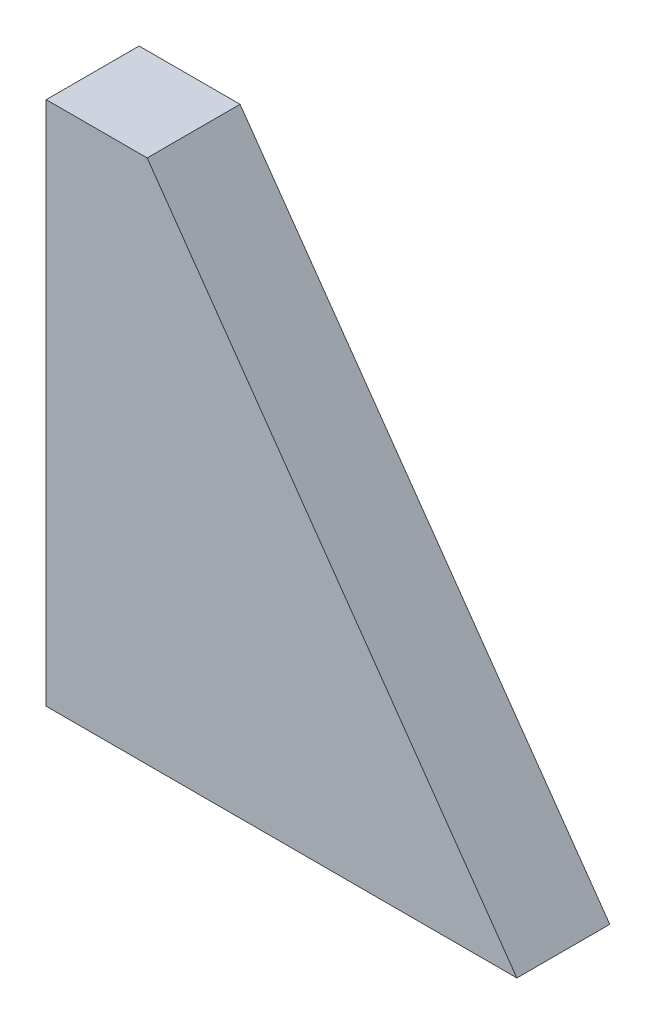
from build123d import *

# Parameters (mm, degrees)
LINEAR_AUSTRAGEN1_DEPTH = 5


with BuildPart() as part:
    # Skizze1 → Linear austragen1 (new, symmetric)
    with BuildSketch(Plane.XY):
        Polygon((0, 56.54601097), (0, 0), (50.658208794, 0), (10.86511746, 56.54601097), align=None)
    extrude(amount=LINEAR_AUSTRAGEN1_DEPTH, both=True)


solid = part.part
